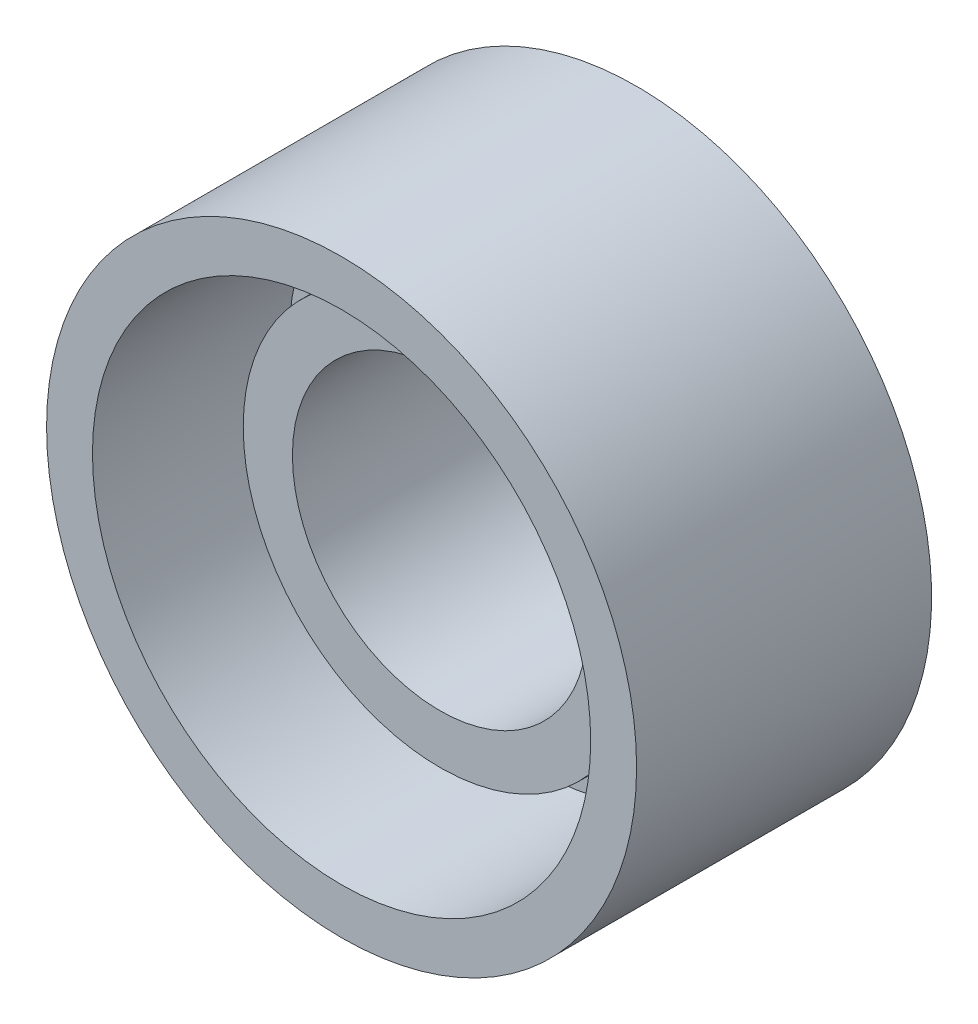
from build123d import *

# Parameters (mm, degrees)
SKETCH_1_R          = 45
SKETCH_1_R_2        = 38
EXTRUDE_1_DEPTH     = 30
SKETCH_2_R          = 30
EXTRUDE_2_DEPTH     = 15
EXTRUDE_START       = 15
SKETCH_3_R          = 45
EXTRUDE_3_DEPTH     = 15
SKETCH_4_R          = 22.5
CUT_EXTRUDE_1_DEPTH = 78.942286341


with BuildPart() as part:
    # Sketch 1 → Extrude 1 (new body)
    with BuildSketch(Plane.XY):
        Circle(SKETCH_1_R)
        Circle(SKETCH_1_R_2, mode=Mode.SUBTRACT)
    extrude(amount=EXTRUDE_1_DEPTH)



with BuildPart() as body_2:
    # Sketch 2 → Extrude 2 (new body)
    with BuildSketch(Plane(origin=(0, 0, 0), x_dir=(-1, 0, 0), z_dir=(0, 0, -1))):
        Circle(SKETCH_2_R)
    extrude(amount=-EXTRUDE_2_DEPTH)


with BuildPart() as part_1:
    add(part.part)

    add(body_2.part)  # Extrude 3 merges body 2
    # Sketch 3 → Extrude 3 (add)
    with BuildSketch(Plane(origin=(0, 0, 0), x_dir=(-1, 0, 0), z_dir=(0, 0, -1)).offset(EXTRUDE_START)):
        Circle(SKETCH_3_R)
    extrude(amount=-EXTRUDE_3_DEPTH)

    # Sketch 4 → Cut-Extrude 1 (cut, through all)
    with BuildSketch(Plane(origin=(0, 0, -15), x_dir=(-1, 0, 0), z_dir=(0, 0, -1))):
        Circle(SKETCH_4_R)
    extrude(amount=-CUT_EXTRUDE_1_DEPTH, mode=Mode.SUBTRACT)


solid = part_1.part
